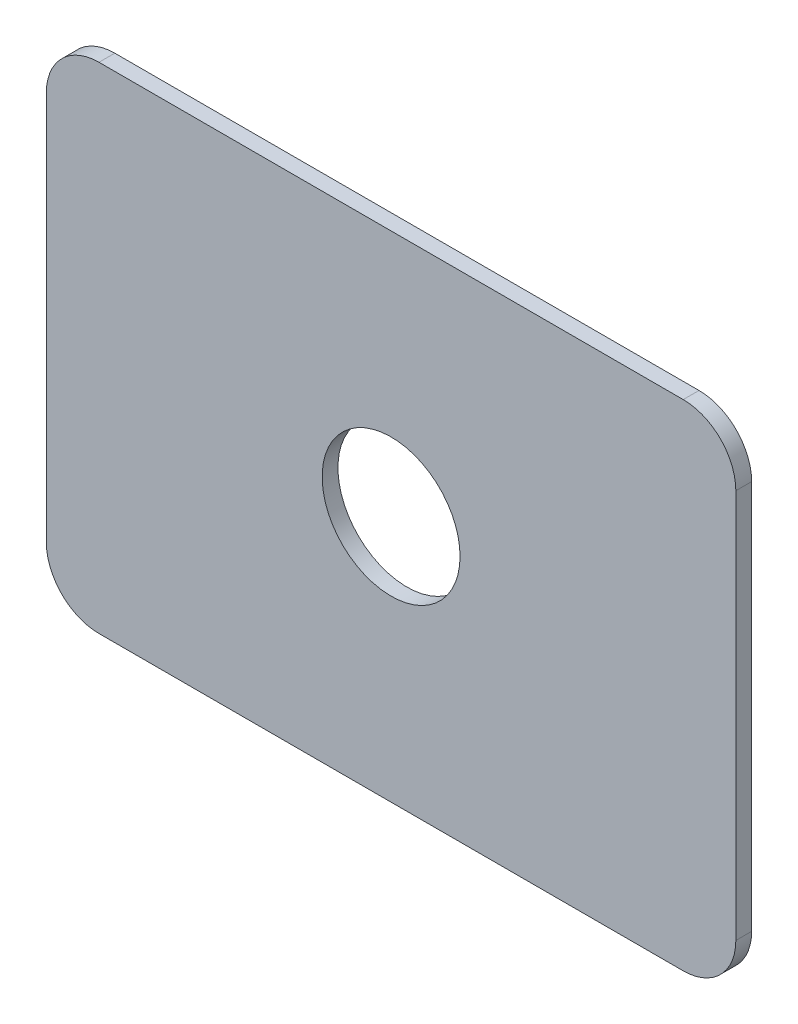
from build123d import *

# Parameters (mm, degrees)
EXTRUSION1_DEPTH        = 6
ESQUISSE2_R             = 26.2
ENL_V_MAT_EXTRU_1_DEPTH = 10


with BuildPart() as part:
    # Esquisse1 → Extrusion1 (new body)
    with BuildSketch(Plane.XY):
        with BuildLine():
            Line((-111, 94), (111, 94))
            ThreePointArc((111, 94), (125.142135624, 88.142135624), (131, 74))
            Line((131, 74), (131, -74))
            ThreePointArc((131, -74), (125.142135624, -88.142135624), (111, -94))
            Line((111, -94), (-111, -94))
            ThreePointArc((-111, -94), (-125.142135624, -88.142135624), (-131, -74))
            Line((-131, -74), (-131, 74))
            ThreePointArc((-131, 74), (-125.142135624, 88.142135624), (-111, 94))
        make_face()
    extrude(amount=EXTRUSION1_DEPTH)

    # Esquisse2 → Enl_v. mat.-Extru.1 (cut)
    with BuildSketch(Plane.XY.offset(6)):
        Circle(ESQUISSE2_R)
    extrude(amount=-ENL_V_MAT_EXTRU_1_DEPTH, mode=Mode.SUBTRACT)


solid = part.part
